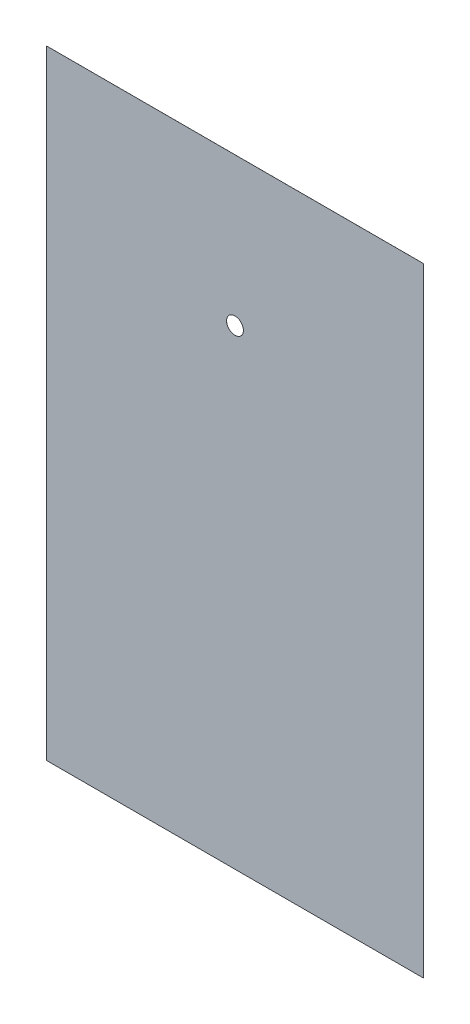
from build123d import *

# Parameters (mm, degrees)
SKETCH1_W           = 50.8
SKETCH1_H           = 50.8
SKETCH1_R           = 7.9375
BOSS_EXTRUDE1_DEPTH = 0.0254
SKETCH2_W           = 355.6
SKETCH2_H           = 584.2
SKETCH2_W_2         = 50.8
SKETCH2_H_2         = 50.8
BOSS_EXTRUDE2_DEPTH = 0.0254


with BuildPart() as part:
    # Sketch1 → Boss-Extrude1 (new body)
    with BuildSketch(Plane.XY):
        Rectangle(SKETCH1_W, SKETCH1_H)
        Circle(SKETCH1_R, mode=Mode.SUBTRACT)
    extrude(amount=BOSS_EXTRUDE1_DEPTH)

    # Sketch2 → Boss-Extrude2 (add)
    with BuildSketch(Plane.XY.offset(0.0254)):
        with Locations((0, -152.4)):
            Rectangle(SKETCH2_W, SKETCH2_H)
        Rectangle(SKETCH2_W_2, SKETCH2_H_2, mode=Mode.SUBTRACT)
    extrude(amount=-BOSS_EXTRUDE2_DEPTH)


solid = part.part
